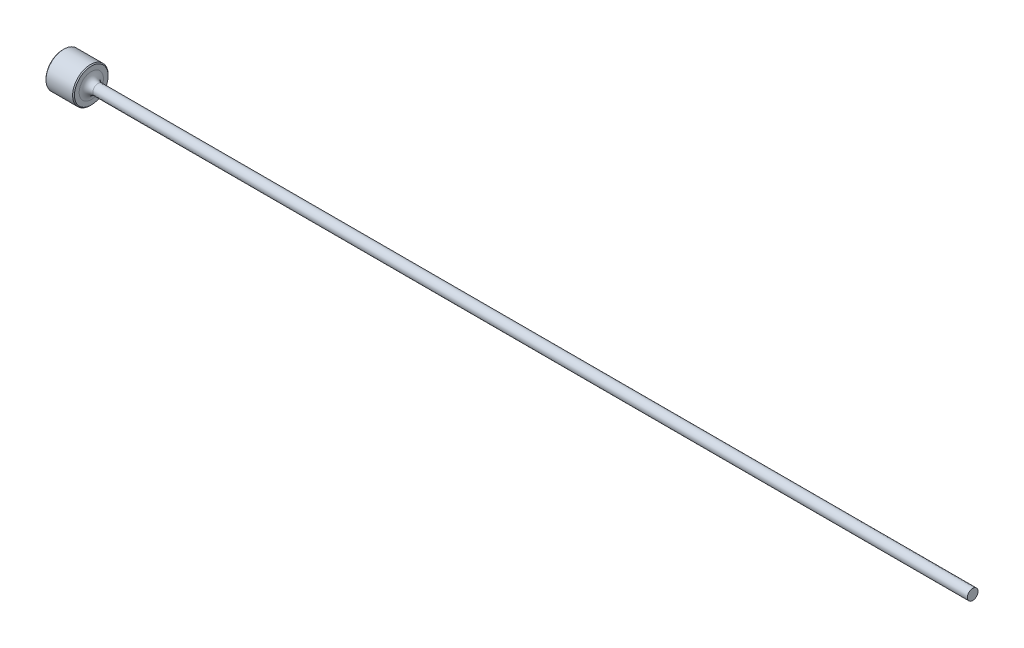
from build123d import *

# Parameters (mm, degrees)
CHAMFER1_SIZE = 0.1016


with BuildPart() as part:
    # Sketch1 → Revolve1 (revolve)
    with BuildSketch(Plane.XY):
        with BuildLine():
            Line((0, 0), (0, 1.984375))
            Line((0, 1.984375), (3.175, 1.984375))
            Line((3.175, 1.984375), (3.175, 1.3535025))
            ThreePointArc((3.175, 1.3535025), (3.398184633, 0.814687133), (3.937, 0.5915025))
            Line((3.937, 0.5915025), (101.6, 0.5915025))
            Line((101.6, 0.5915025), (101.6, 0))
            Line((101.6, 0), (0, 0))
        make_face()
    revolve(axis=Axis((101.6, 0, 0), (-1, 0, 0)))

    # Chamfer1
    chamfer1_edges = [part.edges().sort_by_distance(p)[0] for p in [
        (0, -1.984375, 0),
        (3.175, -1.984375, 0),
    ]]
    chamfer(chamfer1_edges, length=CHAMFER1_SIZE)


solid = part.part
